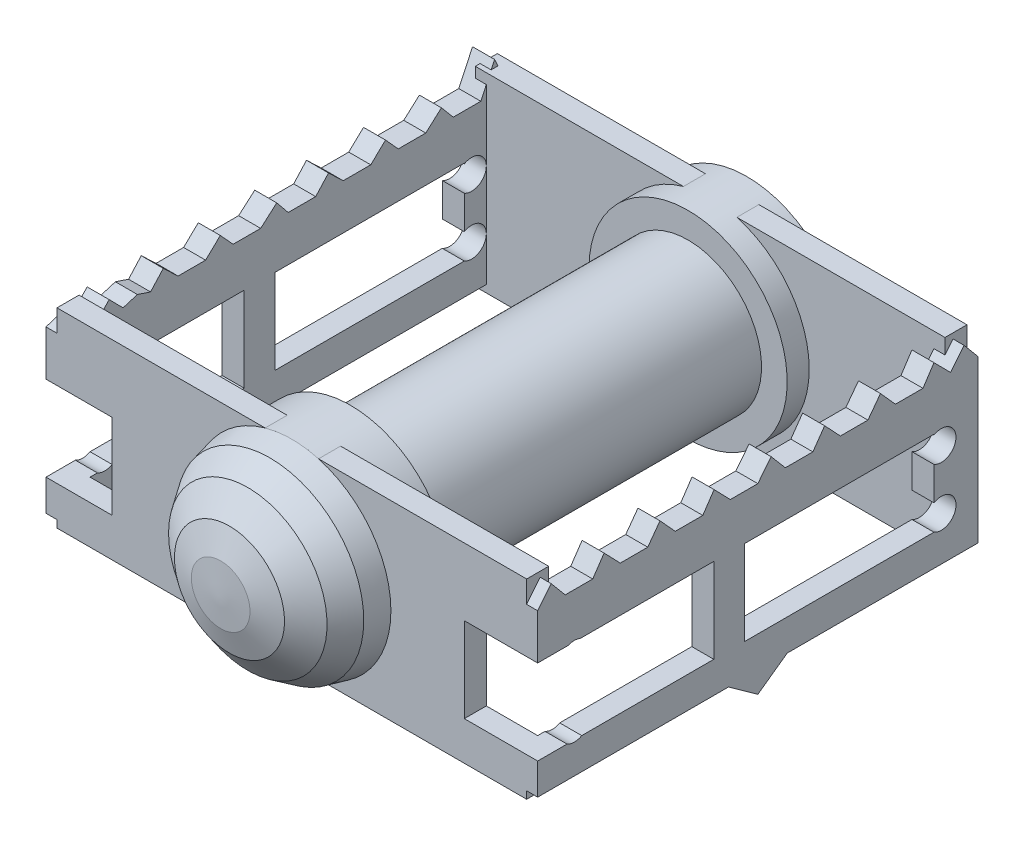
from build123d import *

# Parameters (mm, degrees)
PLACA_DELANTERA_START               = 203
PLACA_DELANTERA_DEPTH               = 3
AGUJERO_PLACA_DELANTERA_1_PROFILE_R = 2
AGUJERO_PLACA_DELANTERA_2_PROFILE_R = 2
AGUJERO_PLACA_DELANTERA_3_PROFILE_R = 2
AGUJERO_PLACA_DELANTERA_4_PROFILE_R = 2
PLACA_TRASERA_START                 = 139
PLACA_TRASERA_DEPTH                 = 3
AGUJERO_PLACA_TRASERA_1_PROFILE_R   = 2
AGUJERO_PLACA_TRASERA_2_PROFILE_R   = 2
AGUJERO_PLACA_TRASERA_3_PROFILE_R   = 2
AGUJERO_PLACA_TRASERA_4_PROFILE_R   = 2
MARCO_INTERIOR_START                = 86
SK_MARCO_INTERIOR_W                 = 64
SK_MARCO_INTERIOR_H                 = 26
SK_MARCO_INTERIOR_R                 = 11
MARCO_INTERIOR_DEPTH                = 3
MARCO_EXTERIOR_START                = 143
SK_MARCO_EXTERIOR_W                 = 64
SK_MARCO_EXTERIOR_H                 = 26
SK_MARCO_EXTERIOR_R                 = 11
MARCO_EXTERIOR_DEPTH                = 3
CROQUIS17_W                         = 25.795648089
CROQUIS17_H                         = 11.561302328
CORTAR_EXTRUIR1_DEPTH               = 10
MATRIZL1_COUNT                      = 2
MATRIZL1_PITCH                      = 30
MATRIZL1_COPY_1_SKETCH_W            = 25.795648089
MATRIZL1_COPY_1_SKETCH_H            = 11.561302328
MATRIZL1_COPY_1_DEPTH               = 10


with BuildPart() as part:
    # Sk_Eje_cuerpo → Eje_cuerpo (revolve)
    with BuildSketch(Plane(origin=(0, 0, 0), x_dir=(1, 0, 0), z_dir=(0, 1, 0)), mode=Mode.PRIVATE) as eje_cuerpo_sk:
        Polygon((183.5, -84), (186, -84), (186, -92), (182.5, -92), (182.5, -138), (186, -138), (186, -146), (185.3, -149), (183.3, -152), (180, -154.5), (176.5, -155.7), (172.5, -156), (172.5, -147), (183.5, -147), (183.5, -138.5), (178.8, -138.5), (178.8, -91.5), (183.5, -91.5), align=None)
    revolve(eje_cuerpo_sk.sketch.rotate(Axis((172.5, 0, 62.1), (0, 0, 1)), 180), axis=Axis((172.5, 0, 62.1), (0, 0, 1)))



with BuildPart() as body_2:
    # Sk_Placa_delantera → Placa_delantera (new body)
    with BuildSketch(Plane(origin=(0, 0, 0), x_dir=(0, 0, -1), z_dir=(1, 0, 0)).offset(PLACA_DELANTERA_START)):
        Polygon((-86, -12), (-112, -12), (-116, -14.871140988), (-120, -12), (-146, -12), (-146, 10), (-144.158210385, 12.281479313), (-142.25, 10), (-140.792887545, 10), (-138.5, 10), (-136.9468043, 12.281479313), (-134.75, 10), (-133.341101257, 10), (-131, 10), (-129.334764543, 12.281479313), (-127.25, 10), (-125.809188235, 10), (-123.5, 10), (-121.96310499, 12.281479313), (-119.75, 10), (-117.956768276, 10), (-116, 10), (-114.190811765, 12.281479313), (-112.25, 10), (-110.665235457, 10), (-108.5, 10), (-106.899278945, 12.281479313), (-104.75, 10), (-103.0531957, 10), (-101, 10), (-99.287239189, 12.281479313), (-97.25, 10), (-95.601409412, 10), (-93.5, 10), (-92, 12.281479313), (-89.75, 10), (-87.909242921, 12.281479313), (-86, 10), align=None)
    extrude(amount=PLACA_DELANTERA_DEPTH)

    # Agujero_Placa_delantera_1: sweep along a curve in space
    with BuildLine() as agujero_placa_delantera_1_path:
        Line((201.5, -6, 91), (207.5, -6, 91))
    # Agujero_Placa_delantera_1 profile (on start of the path) → Agujero_Placa_delantera_1 (sweep, cut)
    with BuildSketch(Plane(origin=(201.5, -6, 91), x_dir=(0, 0, 1), z_dir=(1, 0, 0))):
        Circle(AGUJERO_PLACA_DELANTERA_1_PROFILE_R)
    sweep(path=agujero_placa_delantera_1_path.line, mode=Mode.SUBTRACT)

    # Agujero_Placa_delantera_2: sweep along a curve in space
    with BuildLine() as agujero_placa_delantera_2_path:
        Line((201.5, 2, 91), (207.5, 2, 91))
    # Agujero_Placa_delantera_2 profile (on start of the path) → Agujero_Placa_delantera_2 (sweep, cut)
    with BuildSketch(Plane(origin=(201.5, 2, 91), x_dir=(0, 0, 1), z_dir=(1, 0, 0))):
        Circle(AGUJERO_PLACA_DELANTERA_2_PROFILE_R)
    sweep(path=agujero_placa_delantera_2_path.line, mode=Mode.SUBTRACT)

    # Agujero_Placa_delantera_3: sweep along a curve in space
    with BuildLine() as agujero_placa_delantera_3_path:
        Line((201.5, -6, 141), (207.5, -6, 141))
    # Agujero_Placa_delantera_3 profile (on start of the path) → Agujero_Placa_delantera_3 (sweep, cut)
    with BuildSketch(Plane(origin=(201.5, -6, 141), x_dir=(0, 0, 1), z_dir=(1, 0, 0))):
        Circle(AGUJERO_PLACA_DELANTERA_3_PROFILE_R)
    sweep(path=agujero_placa_delantera_3_path.line, mode=Mode.SUBTRACT)

    # Agujero_Placa_delantera_4: sweep along a curve in space
    with BuildLine() as agujero_placa_delantera_4_path:
        Line((201.5, 2, 141), (207.5, 2, 141))
    # Agujero_Placa_delantera_4 profile (on start of the path) → Agujero_Placa_delantera_4 (sweep, cut)
    with BuildSketch(Plane(origin=(201.5, 2, 141), x_dir=(0, 0, 1), z_dir=(1, 0, 0))):
        Circle(AGUJERO_PLACA_DELANTERA_4_PROFILE_R)
    sweep(path=agujero_placa_delantera_4_path.line, mode=Mode.SUBTRACT)


with BuildPart() as body_3:
    # Sk_Placa_trasera → Placa_trasera (new body)
    with BuildSketch(Plane(origin=(0, 0, 0), x_dir=(0, 0, -1), z_dir=(1, 0, 0)).offset(PLACA_TRASERA_START)):
        Polygon((-86, -12), (-146, -12), (-146, 10), (-144.158210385, 10.594712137), (-142.25, 10), (-140.392253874, 11.91414288), (-138.5, 10), (-136.546170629, 10.594712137), (-134.75, 10), (-133.02059432, 11.91414288), (-131, 10), (-129.014257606, 10), (-127.25, 10), (-125.248301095, 11.91414288), (-123.5, 10), (-121.241964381, 10), (-119.75, 10), (-117.556134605, 11.91414288), (-116, 10), (-113.790178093, 10), (-112.25, 10), (-110.504981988, 11.91414288), (-108.5, 10), (-106.498645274, 10), (-104.75, 10), (-102.732688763, 11.91414288), (-101, 10), (-98.646225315, 10), (-97.25, 10), (-95.120649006, 11.91414288), (-93.5, 10), (-91.274565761, 10), (-89.75, 10), (-87.875, 14), (-86, 10), align=None)
    extrude(amount=PLACA_TRASERA_DEPTH)

    # Agujero_Placa_trasera_1: sweep along a curve in space
    with BuildLine() as agujero_placa_trasera_1_path:
        Line((137.5, -6, 91), (143.5, -6, 91))
    # Agujero_Placa_trasera_1 profile (on start of the path) → Agujero_Placa_trasera_1 (sweep, cut)
    with BuildSketch(Plane(origin=(137.5, -6, 91), x_dir=(0, 0, 1), z_dir=(1, 0, 0))):
        Circle(AGUJERO_PLACA_TRASERA_1_PROFILE_R)
    sweep(path=agujero_placa_trasera_1_path.line, mode=Mode.SUBTRACT)

    # Agujero_Placa_trasera_2: sweep along a curve in space
    with BuildLine() as agujero_placa_trasera_2_path:
        Line((137.5, 2, 91), (143.5, 2, 91))
    # Agujero_Placa_trasera_2 profile (on start of the path) → Agujero_Placa_trasera_2 (sweep, cut)
    with BuildSketch(Plane(origin=(137.5, 2, 91), x_dir=(0, 0, 1), z_dir=(1, 0, 0))):
        Circle(AGUJERO_PLACA_TRASERA_2_PROFILE_R)
    sweep(path=agujero_placa_trasera_2_path.line, mode=Mode.SUBTRACT)

    # Agujero_Placa_trasera_3: sweep along a curve in space
    with BuildLine() as agujero_placa_trasera_3_path:
        Line((137.5, -6, 141), (143.5, -6, 141))
    # Agujero_Placa_trasera_3 profile (on start of the path) → Agujero_Placa_trasera_3 (sweep, cut)
    with BuildSketch(Plane(origin=(137.5, -6, 141), x_dir=(0, 0, 1), z_dir=(1, 0, 0))):
        Circle(AGUJERO_PLACA_TRASERA_3_PROFILE_R)
    sweep(path=agujero_placa_trasera_3_path.line, mode=Mode.SUBTRACT)

    # Agujero_Placa_trasera_4: sweep along a curve in space
    with BuildLine() as agujero_placa_trasera_4_path:
        Line((137.5, 2, 141), (143.5, 2, 141))
    # Agujero_Placa_trasera_4 profile (on start of the path) → Agujero_Placa_trasera_4 (sweep, cut)
    with BuildSketch(Plane(origin=(137.5, 2, 141), x_dir=(0, 0, 1), z_dir=(1, 0, 0))):
        Circle(AGUJERO_PLACA_TRASERA_4_PROFILE_R)
    sweep(path=agujero_placa_trasera_4_path.line, mode=Mode.SUBTRACT)


with BuildPart() as part_1:
    add(part.part)

    add(body_2.part)  # Marco_interior merges body 2

    add(body_3.part)  # Marco_interior merges body 3
    # Sk_Marco_interior → Marco_interior (add)
    with BuildSketch(Plane.XY.offset(MARCO_INTERIOR_START)):
        with Locations((172.5, 0)):
            Rectangle(SK_MARCO_INTERIOR_W, SK_MARCO_INTERIOR_H)
        with Locations(Location((172.5, 0, 0), (0, 0, 180))):
            Circle(SK_MARCO_INTERIOR_R, mode=Mode.SUBTRACT)
    extrude(amount=MARCO_INTERIOR_DEPTH)

    # Sk_Marco_exterior → Marco_exterior (add)
    with BuildSketch(Plane.XY.offset(MARCO_EXTERIOR_START)):
        with Locations((172.5, 0)):
            Rectangle(SK_MARCO_EXTERIOR_W, SK_MARCO_EXTERIOR_H)
        with Locations(Location((172.5, 0, 0), (0, 0, 180))):
            Circle(SK_MARCO_EXTERIOR_R, mode=Mode.SUBTRACT)
    extrude(amount=MARCO_EXTERIOR_DEPTH)

    # Croquis17 → Cortar-Extruir1 (cut)
    with BuildSketch(Plane(origin=(206, 0, 0), x_dir=(0, 0, -1), z_dir=(1, 0, 0))):
        with Locations((-104.897824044, -1.951399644)):
            Rectangle(CROQUIS17_W, CROQUIS17_H)
    cortar_extruir1 = extrude(amount=-CORTAR_EXTRUIR1_DEPTH, mode=Mode.SUBTRACT)

    # Simetr_a1: Cortar-Extruir1 across plane
    add(cortar_extruir1.mirror(Plane(origin=(172, 0, 0), x_dir=(0, 0, 1), z_dir=(1, 0, 0))), mode=Mode.SUBTRACT)

    # MatrizL1: Cortar-Extruir1 ×2
    with Locations(*[(0, 0, i * MATRIZL1_PITCH) for i in range(1, MATRIZL1_COUNT)]):
        add(cortar_extruir1, mode=Mode.SUBTRACT)

    # MatrizL1 copy 1 sketch → MatrizL1 copy 1 (cut)
    with BuildSketch(Plane(origin=(138, 0, 30), x_dir=(0, 0, -1), z_dir=(-1, 0, 0))):
        with Locations((-104.897824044, 1.951399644)):
            Rectangle(MATRIZL1_COPY_1_SKETCH_W, MATRIZL1_COPY_1_SKETCH_H)
    extrude(amount=-MATRIZL1_COPY_1_DEPTH, mode=Mode.SUBTRACT)


solid = part_1.part
